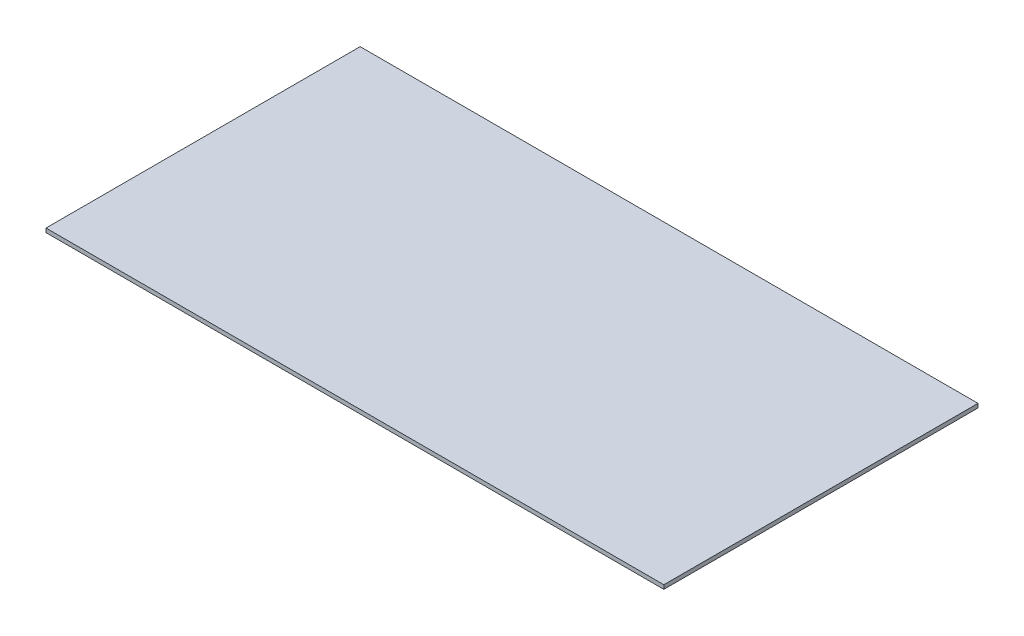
from build123d import *

# Parameters (mm, degrees)
ESQUISSE3_W        = 3084.366889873
ESQUISSE3_H        = 1568.292700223
BOSS_EXTRU_4_DEPTH = 20


with BuildPart() as part:
    # Esquisse3 → Boss.-Extru.4 (new body)
    with BuildSketch(Plane(origin=(0, 0, 0), x_dir=(1, 0, 0), z_dir=(0, 1, 0))):
        with Locations((110.544574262, -26.499285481)):
            Rectangle(ESQUISSE3_W, ESQUISSE3_H)
    extrude(amount=BOSS_EXTRU_4_DEPTH)


solid = part.part
